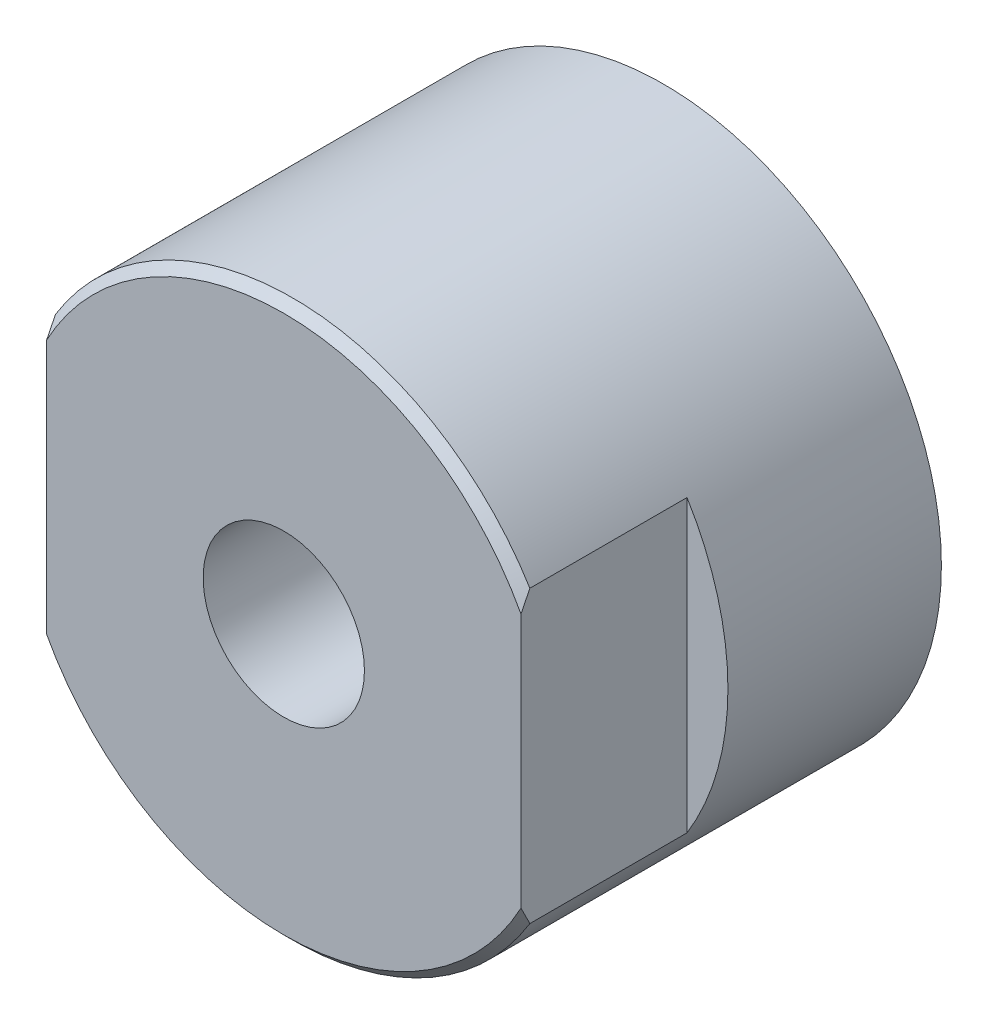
ISO-10303-21;
HEADER;
FILE_DESCRIPTION(('STEP AP214'),'2;1');
FILE_NAME('part.step','',(''),(''),'','','');
FILE_SCHEMA(('AUTOMOTIVE_DESIGN { 1 0 10303 214 1 1 1 1 }'));
ENDSEC;
DATA;
#1=APPLICATION_CONTEXT('core data for automotive mechanical design processes');
#2=APPLICATION_PROTOCOL_DEFINITION('international standard','automotive_design',2000,#1);
#3=PRODUCT_CONTEXT('',#1,'mechanical');
#4=PRODUCT('Part','Part','',(#3));
#5=PRODUCT_RELATED_PRODUCT_CATEGORY('part','',(#4));
#6=PRODUCT_DEFINITION_FORMATION('','',#4);
#7=PRODUCT_DEFINITION_CONTEXT('part definition',#1,'design');
#8=PRODUCT_DEFINITION('design','',#6,#7);
#9=PRODUCT_DEFINITION_SHAPE('','',#8);
#10=(LENGTH_UNIT() NAMED_UNIT(*) SI_UNIT(.MILLI.,.METRE.));
#11=(NAMED_UNIT(*) PLANE_ANGLE_UNIT() SI_UNIT($,.RADIAN.));
#12=(NAMED_UNIT(*) SI_UNIT($,.STERADIAN.) SOLID_ANGLE_UNIT());
#13=UNCERTAINTY_MEASURE_WITH_UNIT(LENGTH_MEASURE(1.E-05),#10,'distance_accuracy_value','');
#14=(GEOMETRIC_REPRESENTATION_CONTEXT(3) GLOBAL_UNCERTAINTY_ASSIGNED_CONTEXT((#13)) GLOBAL_UNIT_ASSIGNED_CONTEXT((#10,
#11,#12)) REPRESENTATION_CONTEXT('',''));
#15=CARTESIAN_POINT('',(0.,0.,0.));
#16=DIRECTION('',(0.,0.,1.));
#17=DIRECTION('',(1.,0.,0.));
#18=AXIS2_PLACEMENT_3D('',#15,#16,#17);
#19=CARTESIAN_POINT('',(0.,0.,0.));
#20=DIRECTION('',(0.,0.,1.));
#21=DIRECTION('',(1.,0.,0.));
#22=AXIS2_PLACEMENT_3D('',#19,#20,#21);
#23=PLANE('',#22);
#24=CARTESIAN_POINT('',(0.,0.,0.));
#25=DIRECTION('',(0.,0.,1.));
#26=DIRECTION('',(1.,0.,0.));
#27=AXIS2_PLACEMENT_3D('',#24,#25,#26);
#28=CIRCLE('',#27,6.1214);
#29=CARTESIAN_POINT('',(6.1214,0.,0.));
#30=VERTEX_POINT('',#29);
#31=EDGE_CURVE('E38',#30,#30,#28,.F.);
#32=ORIENTED_EDGE('',*,*,#31,.T.);
#33=EDGE_LOOP('',(#32));
#34=FACE_BOUND('',#33,.T.);
#35=CARTESIAN_POINT('',(0.,0.,0.));
#36=DIRECTION('',(0.,0.,-1.));
#37=DIRECTION('',(-1.,0.,0.));
#38=AXIS2_PLACEMENT_3D('',#35,#36,#37);
#39=CIRCLE('',#38,4.2164);
#40=CARTESIAN_POINT('',(-4.2164,0.,0.));
#41=VERTEX_POINT('',#40);
#42=EDGE_CURVE('E108',#41,#41,#39,.T.);
#43=ORIENTED_EDGE('',*,*,#42,.F.);
#44=EDGE_LOOP('',(#43));
#45=FACE_BOUND('',#44,.T.);
#46=ADVANCED_FACE('F30',(#34,#45),#23,.F.);
#47=CARTESIAN_POINT('',(0.,0.,0.));
#48=DIRECTION('',(0.,0.,1.));
#49=DIRECTION('',(1.,0.,0.));
#50=AXIS2_PLACEMENT_3D('',#47,#48,#49);
#51=CYLINDRICAL_SURFACE('',#50,3.4544);
#52=CARTESIAN_POINT('',(0.,0.,16.256));
#53=DIRECTION('',(0.,0.,1.));
#54=DIRECTION('',(1.,0.,0.));
#55=AXIS2_PLACEMENT_3D('',#52,#53,#54);
#56=CIRCLE('',#55,3.4544);
#57=CARTESIAN_POINT('',(3.4544,0.,16.256));
#58=VERTEX_POINT('',#57);
#59=EDGE_CURVE('E115',#58,#58,#56,.T.);
#60=ORIENTED_EDGE('',*,*,#59,.T.);
#61=EDGE_LOOP('',(#60));
#62=FACE_BOUND('',#61,.T.);
#63=CARTESIAN_POINT('',(0.,0.,9.906));
#64=DIRECTION('',(0.,0.,-1.));
#65=DIRECTION('',(-1.,0.,0.));
#66=AXIS2_PLACEMENT_3D('',#63,#64,#65);
#67=CIRCLE('',#66,3.4544);
#68=CARTESIAN_POINT('',(-3.4544,0.,9.906));
#69=VERTEX_POINT('',#68);
#70=EDGE_CURVE('E114',#69,#69,#67,.F.);
#71=ORIENTED_EDGE('',*,*,#70,.F.);
#72=EDGE_LOOP('',(#71));
#73=FACE_BOUND('',#72,.T.);
#74=ADVANCED_FACE('F181',(#62,#73),#51,.F.);
#75=CARTESIAN_POINT('',(0.,0.,16.256));
#76=DIRECTION('',(0.,0.,-1.));
#77=DIRECTION('',(-1.,0.,0.));
#78=AXIS2_PLACEMENT_3D('',#75,#76,#77);
#79=CYLINDRICAL_SURFACE('',#78,11.9126);
#80=DIRECTION('',(0.,0.,-1.));
#81=VECTOR('',#80,1.);
#82=CARTESIAN_POINT('',(10.16,-6.21968156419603,16.256));
#83=LINE('',#82,#81);
#84=CARTESIAN_POINT('',(10.16,-6.21968156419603,9.144));
#85=VERTEX_POINT('',#84);
#86=CARTESIAN_POINT('',(10.16,-6.21968156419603,15.875));
#87=VERTEX_POINT('',#86);
#88=EDGE_CURVE('E104',#85,#87,#83,.F.);
#89=ORIENTED_EDGE('',*,*,#88,.T.);
#90=CARTESIAN_POINT('',(0.,0.,15.875));
#91=DIRECTION('',(0.,0.,1.));
#92=DIRECTION('',(1.,0.,0.));
#93=AXIS2_PLACEMENT_3D('',#90,#91,#92);
#94=CIRCLE('',#93,11.9126);
#95=CARTESIAN_POINT('',(-10.16,-6.21968156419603,15.875));
#96=VERTEX_POINT('',#95);
#97=EDGE_CURVE('E53',#87,#96,#94,.F.);
#98=ORIENTED_EDGE('',*,*,#97,.T.);
#99=DIRECTION('',(0.,0.,-1.));
#100=VECTOR('',#99,1.);
#101=CARTESIAN_POINT('',(-10.16,-6.21968156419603,16.256));
#102=LINE('',#101,#100);
#103=CARTESIAN_POINT('',(-10.16,-6.21968156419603,9.144));
#104=VERTEX_POINT('',#103);
#105=EDGE_CURVE('E82',#96,#104,#102,.T.);
#106=ORIENTED_EDGE('',*,*,#105,.T.);
#107=CARTESIAN_POINT('',(0.,0.,9.144));
#108=DIRECTION('',(0.,0.,1.));
#109=DIRECTION('',(1.,0.,0.));
#110=AXIS2_PLACEMENT_3D('',#107,#108,#109);
#111=CIRCLE('',#110,11.9126);
#112=CARTESIAN_POINT('',(-10.16,6.21968156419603,9.144));
#113=VERTEX_POINT('',#112);
#114=EDGE_CURVE('E85',#113,#104,#111,.T.);
#115=ORIENTED_EDGE('',*,*,#114,.F.);
#116=DIRECTION('',(0.,0.,-1.));
#117=VECTOR('',#116,1.);
#118=CARTESIAN_POINT('',(-10.16,6.21968156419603,16.256));
#119=LINE('',#118,#117);
#120=CARTESIAN_POINT('',(-10.16,6.21968156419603,15.875));
#121=VERTEX_POINT('',#120);
#122=EDGE_CURVE('E89',#113,#121,#119,.F.);
#123=ORIENTED_EDGE('',*,*,#122,.T.);
#124=CARTESIAN_POINT('',(0.,0.,15.875));
#125=DIRECTION('',(0.,0.,1.));
#126=DIRECTION('',(1.,0.,0.));
#127=AXIS2_PLACEMENT_3D('',#124,#125,#126);
#128=CIRCLE('',#127,11.9126);
#129=CARTESIAN_POINT('',(10.16,6.21968156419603,15.875));
#130=VERTEX_POINT('',#129);
#131=EDGE_CURVE('E381',#121,#130,#128,.F.);
#132=ORIENTED_EDGE('',*,*,#131,.T.);
#133=DIRECTION('',(0.,0.,-1.));
#134=VECTOR('',#133,1.);
#135=CARTESIAN_POINT('',(10.16,6.21968156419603,16.256));
#136=LINE('',#135,#134);
#137=CARTESIAN_POINT('',(10.16,6.21968156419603,9.144));
#138=VERTEX_POINT('',#137);
#139=EDGE_CURVE('E106',#130,#138,#136,.T.);
#140=ORIENTED_EDGE('',*,*,#139,.T.);
#141=CARTESIAN_POINT('',(0.,0.,9.144));
#142=DIRECTION('',(0.,0.,-1.));
#143=DIRECTION('',(-1.,0.,0.));
#144=AXIS2_PLACEMENT_3D('',#141,#142,#143);
#145=CIRCLE('',#144,11.9126);
#146=EDGE_CURVE('E126',#138,#85,#145,.T.);
#147=ORIENTED_EDGE('',*,*,#146,.T.);
#148=EDGE_LOOP('',(#89,#98,#106,#115,#123,#132,#140,#147));
#149=FACE_BOUND('',#148,.T.);
#150=CARTESIAN_POINT('',(0.,0.,0.));
#151=DIRECTION('',(0.,0.,1.));
#152=DIRECTION('',(1.,0.,0.));
#153=AXIS2_PLACEMENT_3D('',#150,#151,#152);
#154=CIRCLE('',#153,11.9126);
#155=CARTESIAN_POINT('',(11.9126,0.,0.));
#156=VERTEX_POINT('',#155);
#157=EDGE_CURVE('E118',#156,#156,#154,.T.);
#158=ORIENTED_EDGE('',*,*,#157,.T.);
#159=EDGE_LOOP('',(#158));
#160=FACE_BOUND('',#159,.T.);
#161=ADVANCED_FACE('F32',(#149,#160),#79,.T.);
#162=CARTESIAN_POINT('',(0.,0.,16.256));
#163=DIRECTION('',(0.,0.,1.));
#164=DIRECTION('',(1.,0.,0.));
#165=AXIS2_PLACEMENT_3D('',#162,#163,#164);
#166=PLANE('',#165);
#167=DIRECTION('',(0.,1.,0.));
#168=VECTOR('',#167,1.);
#169=CARTESIAN_POINT('',(-10.16,0.,16.256));
#170=LINE('',#169,#168);
#171=CARTESIAN_POINT('',(-10.16,-5.4545575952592,16.256));
#172=VERTEX_POINT('',#171);
#173=CARTESIAN_POINT('',(-10.16,5.4545575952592,16.256));
#174=VERTEX_POINT('',#173);
#175=EDGE_CURVE('E96',#172,#174,#170,.T.);
#176=ORIENTED_EDGE('',*,*,#175,.F.);
#177=CARTESIAN_POINT('',(0.,0.,16.256));
#178=DIRECTION('',(0.,0.,1.));
#179=DIRECTION('',(1.,0.,0.));
#180=AXIS2_PLACEMENT_3D('',#177,#178,#179);
#181=CIRCLE('',#180,11.5316);
#182=CARTESIAN_POINT('',(10.16,-5.4545575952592,16.256));
#183=VERTEX_POINT('',#182);
#184=EDGE_CURVE('E132',#172,#183,#181,.T.);
#185=ORIENTED_EDGE('',*,*,#184,.T.);
#186=DIRECTION('',(0.,-1.,0.));
#187=VECTOR('',#186,1.);
#188=CARTESIAN_POINT('',(10.16,0.,16.256));
#189=LINE('',#188,#187);
#190=CARTESIAN_POINT('',(10.16,5.4545575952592,16.256));
#191=VERTEX_POINT('',#190);
#192=EDGE_CURVE('E121',#191,#183,#189,.T.);
#193=ORIENTED_EDGE('',*,*,#192,.F.);
#194=CARTESIAN_POINT('',(0.,0.,16.256));
#195=DIRECTION('',(0.,0.,1.));
#196=DIRECTION('',(1.,0.,0.));
#197=AXIS2_PLACEMENT_3D('',#194,#195,#196);
#198=CIRCLE('',#197,11.5316);
#199=EDGE_CURVE('E95',#191,#174,#198,.T.);
#200=ORIENTED_EDGE('',*,*,#199,.T.);
#201=EDGE_LOOP('',(#176,#185,#193,#200));
#202=FACE_BOUND('',#201,.T.);
#203=ORIENTED_EDGE('',*,*,#59,.F.);
#204=EDGE_LOOP('',(#203));
#205=FACE_BOUND('',#204,.T.);
#206=ADVANCED_FACE('F186',(#202,#205),#166,.T.);
#207=CARTESIAN_POINT('',(0.,0.,0.));
#208=DIRECTION('',(0.,0.,1.));
#209=DIRECTION('',(1.,0.,0.));
#210=AXIS2_PLACEMENT_3D('',#207,#208,#209);
#211=CIRCLE('',#210,8.4582);
#212=CARTESIAN_POINT('',(8.4582,0.,0.));
#213=VERTEX_POINT('',#212);
#214=EDGE_CURVE('E205',#213,#213,#211,.T.);
#215=ORIENTED_EDGE('',*,*,#214,.T.);
#216=EDGE_LOOP('',(#215));
#217=FACE_BOUND('',#216,.T.);
#218=ORIENTED_EDGE('',*,*,#157,.F.);
#219=EDGE_LOOP('',(#218));
#220=FACE_BOUND('',#219,.T.);
#221=ADVANCED_FACE('F176',(#217,#220),#23,.F.);
#222=CARTESIAN_POINT('',(0.,0.,9.906));
#223=DIRECTION('',(0.,0.,-1.));
#224=DIRECTION('',(-1.,0.,0.));
#225=AXIS2_PLACEMENT_3D('',#222,#223,#224);
#226=PLANE('',#225);
#227=CARTESIAN_POINT('',(0.,0.,9.906));
#228=DIRECTION('',(0.,0.,-1.));
#229=DIRECTION('',(-1.,0.,0.));
#230=AXIS2_PLACEMENT_3D('',#227,#228,#229);
#231=CIRCLE('',#230,4.2164);
#232=CARTESIAN_POINT('',(-4.2164,0.,9.906));
#233=VERTEX_POINT('',#232);
#234=EDGE_CURVE('E111',#233,#233,#231,.T.);
#235=ORIENTED_EDGE('',*,*,#234,.T.);
#236=EDGE_LOOP('',(#235));
#237=FACE_BOUND('',#236,.T.);
#238=ORIENTED_EDGE('',*,*,#70,.T.);
#239=EDGE_LOOP('',(#238));
#240=FACE_BOUND('',#239,.T.);
#241=ADVANCED_FACE('F173',(#237,#240),#226,.T.);
#242=CARTESIAN_POINT('',(0.,0.,9.906));
#243=DIRECTION('',(0.,0.,-1.));
#244=DIRECTION('',(-1.,0.,0.));
#245=AXIS2_PLACEMENT_3D('',#242,#243,#244);
#246=CYLINDRICAL_SURFACE('',#245,4.2164);
#247=ORIENTED_EDGE('',*,*,#234,.F.);
#248=EDGE_LOOP('',(#247));
#249=FACE_BOUND('',#248,.T.);
#250=ORIENTED_EDGE('',*,*,#42,.T.);
#251=EDGE_LOOP('',(#250));
#252=FACE_BOUND('',#251,.T.);
#253=ADVANCED_FACE('F171',(#249,#252),#246,.F.);
#254=CARTESIAN_POINT('',(0.,0.,1.397));
#255=DIRECTION('',(0.,0.,-1.));
#256=DIRECTION('',(-1.,0.,0.));
#257=AXIS2_PLACEMENT_3D('',#254,#255,#256);
#258=CYLINDRICAL_SURFACE('',#257,8.3312);
#259=CARTESIAN_POINT('',(0.,0.,0.127));
#260=DIRECTION('',(0.,0.,1.));
#261=DIRECTION('',(1.,0.,0.));
#262=AXIS2_PLACEMENT_3D('',#259,#260,#261);
#263=CIRCLE('',#262,8.3312);
#264=CARTESIAN_POINT('',(8.3312,0.,0.127));
#265=VERTEX_POINT('',#264);
#266=EDGE_CURVE('E207',#265,#265,#263,.F.);
#267=ORIENTED_EDGE('',*,*,#266,.T.);
#268=EDGE_LOOP('',(#267));
#269=FACE_BOUND('',#268,.T.);
#270=CARTESIAN_POINT('',(0.,0.,1.016));
#271=DIRECTION('',(0.,0.,-1.));
#272=DIRECTION('',(-1.,0.,0.));
#273=AXIS2_PLACEMENT_3D('',#270,#271,#272);
#274=CIRCLE('',#273,8.3312);
#275=CARTESIAN_POINT('',(-8.3312,0.,1.016));
#276=VERTEX_POINT('',#275);
#277=EDGE_CURVE('E215',#276,#276,#274,.F.);
#278=ORIENTED_EDGE('',*,*,#277,.T.);
#279=EDGE_LOOP('',(#278));
#280=FACE_BOUND('',#279,.T.);
#281=ADVANCED_FACE('F167',(#269,#280),#258,.F.);
#282=CARTESIAN_POINT('',(0.,0.,1.397));
#283=DIRECTION('',(0.,0.,-1.));
#284=DIRECTION('',(-1.,0.,0.));
#285=AXIS2_PLACEMENT_3D('',#282,#283,#284);
#286=PLANE('',#285);
#287=CARTESIAN_POINT('',(0.,0.,1.397));
#288=DIRECTION('',(0.,0.,-1.));
#289=DIRECTION('',(-1.,0.,0.));
#290=AXIS2_PLACEMENT_3D('',#287,#288,#289);
#291=CIRCLE('',#290,7.9502);
#292=CARTESIAN_POINT('',(-7.9502,0.,1.397));
#293=VERTEX_POINT('',#292);
#294=EDGE_CURVE('E218',#293,#293,#291,.T.);
#295=ORIENTED_EDGE('',*,*,#294,.T.);
#296=EDGE_LOOP('',(#295));
#297=FACE_BOUND('',#296,.T.);
#298=CARTESIAN_POINT('',(0.,0.,1.397));
#299=DIRECTION('',(0.,0.,-1.));
#300=DIRECTION('',(-1.,0.,0.));
#301=AXIS2_PLACEMENT_3D('',#298,#299,#300);
#302=CIRCLE('',#301,6.6294);
#303=CARTESIAN_POINT('',(-6.6294,0.,1.397));
#304=VERTEX_POINT('',#303);
#305=EDGE_CURVE('E221',#304,#304,#302,.F.);
#306=ORIENTED_EDGE('',*,*,#305,.T.);
#307=EDGE_LOOP('',(#306));
#308=FACE_BOUND('',#307,.T.);
#309=ADVANCED_FACE('F163',(#297,#308),#286,.T.);
#310=CARTESIAN_POINT('',(0.,0.,1.397));
#311=DIRECTION('',(0.,0.,-1.));
#312=DIRECTION('',(-1.,0.,0.));
#313=AXIS2_PLACEMENT_3D('',#310,#311,#312);
#314=CYLINDRICAL_SURFACE('',#313,6.2484);
#315=CARTESIAN_POINT('',(0.,0.,0.127));
#316=DIRECTION('',(0.,0.,1.));
#317=DIRECTION('',(1.,0.,0.));
#318=AXIS2_PLACEMENT_3D('',#315,#316,#317);
#319=CIRCLE('',#318,6.2484);
#320=CARTESIAN_POINT('',(6.2484,0.,0.127));
#321=VERTEX_POINT('',#320);
#322=EDGE_CURVE('E11',#321,#321,#319,.T.);
#323=ORIENTED_EDGE('',*,*,#322,.T.);
#324=EDGE_LOOP('',(#323));
#325=FACE_BOUND('',#324,.T.);
#326=CARTESIAN_POINT('',(0.,0.,1.016));
#327=DIRECTION('',(0.,0.,-1.));
#328=DIRECTION('',(-1.,0.,0.));
#329=AXIS2_PLACEMENT_3D('',#326,#327,#328);
#330=CIRCLE('',#329,6.2484);
#331=CARTESIAN_POINT('',(-6.2484,0.,1.016));
#332=VERTEX_POINT('',#331);
#333=EDGE_CURVE('E212',#332,#332,#330,.T.);
#334=ORIENTED_EDGE('',*,*,#333,.T.);
#335=EDGE_LOOP('',(#334));
#336=FACE_BOUND('',#335,.T.);
#337=ADVANCED_FACE('F159',(#325,#336),#314,.T.);
#338=CARTESIAN_POINT('',(10.16,12.9139489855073,9.144));
#339=DIRECTION('',(0.,0.,-1.));
#340=DIRECTION('',(-1.,0.,0.));
#341=AXIS2_PLACEMENT_3D('',#338,#339,#340);
#342=PLANE('',#341);
#343=DIRECTION('',(0.,-1.,0.));
#344=VECTOR('',#343,1.);
#345=CARTESIAN_POINT('',(10.16,12.9139489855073,9.144));
#346=LINE('',#345,#344);
#347=EDGE_CURVE('E88',#138,#85,#346,.T.);
#348=ORIENTED_EDGE('',*,*,#347,.T.);
#349=ORIENTED_EDGE('',*,*,#146,.F.);
#350=EDGE_LOOP('',(#348,#349));
#351=FACE_BOUND('',#350,.T.);
#352=ADVANCED_FACE('F156',(#351),#342,.F.);
#353=CARTESIAN_POINT('',(10.16,12.9139489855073,9.144));
#354=DIRECTION('',(-1.,0.,0.));
#355=DIRECTION('',(0.,0.,1.));
#356=AXIS2_PLACEMENT_3D('',#353,#354,#355);
#357=PLANE('',#356);
#358=ORIENTED_EDGE('',*,*,#192,.T.);
#359=CARTESIAN_POINT('',(10.16,-5.4545575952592,16.256));
#360=CARTESIAN_POINT('',(10.16,-5.51895345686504,16.2255399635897));
#361=CARTESIAN_POINT('',(10.16,-5.58318732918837,16.1947381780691));
#362=CARTESIAN_POINT('',(10.16,-5.7113307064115,16.1324826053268));
#363=CARTESIAN_POINT('',(10.16,-5.77524024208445,16.1010288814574));
#364=CARTESIAN_POINT('',(10.16,-5.90274669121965,16.0374951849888));
#365=CARTESIAN_POINT('',(10.16,-5.96634360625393,16.0054152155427));
#366=CARTESIAN_POINT('',(10.16,-6.09323752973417,15.9406524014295));
#367=CARTESIAN_POINT('',(10.16,-6.15653450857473,15.9079694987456));
#368=CARTESIAN_POINT('',(10.16,-6.21968156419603,15.875));
#369=B_SPLINE_CURVE_WITH_KNOTS('',3,(#359,#360,#361,#362,#363,#364,#365,#366,#367,#368),
.UNSPECIFIED.,.F.,.F.,(4,2,2,2,4),(0.,0.213708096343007,0.427395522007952,0.641081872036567,
0.854788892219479),.UNSPECIFIED.);
#370=EDGE_CURVE('E142',#183,#87,#369,.T.);
#371=ORIENTED_EDGE('',*,*,#370,.T.);
#372=ORIENTED_EDGE('',*,*,#88,.F.);
#373=ORIENTED_EDGE('',*,*,#347,.F.);
#374=ORIENTED_EDGE('',*,*,#139,.F.);
#375=CARTESIAN_POINT('',(10.16,6.21968156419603,15.875));
#376=CARTESIAN_POINT('',(10.16,6.15653450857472,15.9079694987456));
#377=CARTESIAN_POINT('',(10.16,6.09323752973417,15.9406524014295));
#378=CARTESIAN_POINT('',(10.16,5.96634360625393,16.0054152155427));
#379=CARTESIAN_POINT('',(10.16,5.90274669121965,16.0374951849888));
#380=CARTESIAN_POINT('',(10.16,5.77524024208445,16.1010288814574));
#381=CARTESIAN_POINT('',(10.16,5.7113307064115,16.1324826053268));
#382=CARTESIAN_POINT('',(10.16,5.58318732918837,16.1947381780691));
#383=CARTESIAN_POINT('',(10.16,5.51895345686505,16.2255399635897));
#384=CARTESIAN_POINT('',(10.16,5.45455759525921,16.256));
#385=B_SPLINE_CURVE_WITH_KNOTS('',3,(#375,#376,#377,#378,#379,#380,#381,#382,#383,#384),
.UNSPECIFIED.,.F.,.F.,(4,2,2,2,4),(0.,0.213707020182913,0.427393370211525,0.641080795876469,
0.854788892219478),.UNSPECIFIED.);
#386=EDGE_CURVE('E135',#130,#191,#385,.T.);
#387=ORIENTED_EDGE('',*,*,#386,.T.);
#388=EDGE_LOOP('',(#358,#371,#372,#373,#374,#387));
#389=FACE_BOUND('',#388,.T.);
#390=ADVANCED_FACE('F151',(#389),#357,.F.);
#391=CARTESIAN_POINT('',(-10.16,12.9139489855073,9.144));
#392=DIRECTION('',(0.,0.,1.));
#393=DIRECTION('',(1.,0.,0.));
#394=AXIS2_PLACEMENT_3D('',#391,#392,#393);
#395=PLANE('',#394);
#396=ORIENTED_EDGE('',*,*,#114,.T.);
#397=DIRECTION('',(0.,1.,0.));
#398=VECTOR('',#397,1.);
#399=CARTESIAN_POINT('',(-10.16,12.9139489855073,9.144));
#400=LINE('',#399,#398);
#401=EDGE_CURVE('E94',#104,#113,#400,.T.);
#402=ORIENTED_EDGE('',*,*,#401,.T.);
#403=EDGE_LOOP('',(#396,#402));
#404=FACE_BOUND('',#403,.T.);
#405=ADVANCED_FACE('F93',(#404),#395,.T.);
#406=CARTESIAN_POINT('',(-10.16,12.9139489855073,9.144));
#407=DIRECTION('',(1.,0.,0.));
#408=DIRECTION('',(0.,0.,-1.));
#409=AXIS2_PLACEMENT_3D('',#406,#407,#408);
#410=PLANE('',#409);
#411=ORIENTED_EDGE('',*,*,#105,.F.);
#412=CARTESIAN_POINT('',(-10.16,-6.21968156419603,15.875));
#413=CARTESIAN_POINT('',(-10.16,-6.15653450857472,15.9079694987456));
#414=CARTESIAN_POINT('',(-10.16,-6.09323752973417,15.9406524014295));
#415=CARTESIAN_POINT('',(-10.16,-5.96634360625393,16.0054152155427));
#416=CARTESIAN_POINT('',(-10.16,-5.90274669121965,16.0374951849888));
#417=CARTESIAN_POINT('',(-10.16,-5.77524024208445,16.1010288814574));
#418=CARTESIAN_POINT('',(-10.16,-5.7113307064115,16.1324826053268));
#419=CARTESIAN_POINT('',(-10.16,-5.58318732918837,16.1947381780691));
#420=CARTESIAN_POINT('',(-10.16,-5.51895345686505,16.2255399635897));
#421=CARTESIAN_POINT('',(-10.16,-5.45455759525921,16.256));
#422=B_SPLINE_CURVE_WITH_KNOTS('',3,(#412,#413,#414,#415,#416,#417,#418,#419,#420,#421),
.UNSPECIFIED.,.F.,.F.,(4,2,2,2,4),(0.,0.213707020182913,0.427393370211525,0.641080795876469,
0.854788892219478),.UNSPECIFIED.);
#423=EDGE_CURVE('E224',#96,#172,#422,.T.);
#424=ORIENTED_EDGE('',*,*,#423,.T.);
#425=ORIENTED_EDGE('',*,*,#175,.T.);
#426=CARTESIAN_POINT('',(-10.16,5.4545575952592,16.256));
#427=CARTESIAN_POINT('',(-10.16,5.51895345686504,16.2255399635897));
#428=CARTESIAN_POINT('',(-10.16,5.58318732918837,16.1947381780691));
#429=CARTESIAN_POINT('',(-10.16,5.7113307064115,16.1324826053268));
#430=CARTESIAN_POINT('',(-10.16,5.77524024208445,16.1010288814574));
#431=CARTESIAN_POINT('',(-10.16,5.90274669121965,16.0374951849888));
#432=CARTESIAN_POINT('',(-10.16,5.96634360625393,16.0054152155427));
#433=CARTESIAN_POINT('',(-10.16,6.09323752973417,15.9406524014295));
#434=CARTESIAN_POINT('',(-10.16,6.15653450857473,15.9079694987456));
#435=CARTESIAN_POINT('',(-10.16,6.21968156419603,15.875));
#436=B_SPLINE_CURVE_WITH_KNOTS('',3,(#426,#427,#428,#429,#430,#431,#432,#433,#434,#435),
.UNSPECIFIED.,.F.,.F.,(4,2,2,2,4),(0.,0.213708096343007,0.427395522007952,0.641081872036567,
0.854788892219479),.UNSPECIFIED.);
#437=EDGE_CURVE('E45',#174,#121,#436,.T.);
#438=ORIENTED_EDGE('',*,*,#437,.T.);
#439=ORIENTED_EDGE('',*,*,#122,.F.);
#440=ORIENTED_EDGE('',*,*,#401,.F.);
#441=EDGE_LOOP('',(#411,#424,#425,#438,#439,#440));
#442=FACE_BOUND('',#441,.T.);
#443=ADVANCED_FACE('F98',(#442),#410,.F.);
#444=CARTESIAN_POINT('',(0.,0.,16.256));
#445=DIRECTION('',(0.,0.,-1.));
#446=DIRECTION('',(-1.,0.,0.));
#447=AXIS2_PLACEMENT_3D('',#444,#445,#446);
#448=CONICAL_SURFACE('',#447,11.5316,0.785398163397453);
#449=ORIENTED_EDGE('',*,*,#423,.F.);
#450=ORIENTED_EDGE('',*,*,#97,.F.);
#451=ORIENTED_EDGE('',*,*,#370,.F.);
#452=ORIENTED_EDGE('',*,*,#184,.F.);
#453=EDGE_LOOP('',(#449,#450,#451,#452));
#454=FACE_BOUND('',#453,.T.);
#455=ADVANCED_FACE('F233',(#454),#448,.T.);
#456=CARTESIAN_POINT('',(0.,0.,16.256));
#457=DIRECTION('',(0.,0.,-1.));
#458=DIRECTION('',(-1.,0.,0.));
#459=AXIS2_PLACEMENT_3D('',#456,#457,#458);
#460=CONICAL_SURFACE('',#459,11.5316,0.785398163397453);
#461=ORIENTED_EDGE('',*,*,#386,.F.);
#462=ORIENTED_EDGE('',*,*,#131,.F.);
#463=ORIENTED_EDGE('',*,*,#437,.F.);
#464=ORIENTED_EDGE('',*,*,#199,.F.);
#465=EDGE_LOOP('',(#461,#462,#463,#464));
#466=FACE_BOUND('',#465,.T.);
#467=ADVANCED_FACE('F148',(#466),#460,.T.);
#468=CARTESIAN_POINT('',(0.,0.,1.016));
#469=DIRECTION('',(0.,0.,-1.));
#470=DIRECTION('',(-1.,0.,0.));
#471=AXIS2_PLACEMENT_3D('',#468,#469,#470);
#472=TOROIDAL_SURFACE('',#471,7.9502,0.381);
#473=ORIENTED_EDGE('',*,*,#277,.F.);
#474=EDGE_LOOP('',(#473));
#475=FACE_BOUND('',#474,.T.);
#476=ORIENTED_EDGE('',*,*,#294,.F.);
#477=EDGE_LOOP('',(#476));
#478=FACE_BOUND('',#477,.T.);
#479=ADVANCED_FACE('F261',(#475,#478),#472,.F.);
#480=CARTESIAN_POINT('',(0.,0.,1.016));
#481=DIRECTION('',(0.,0.,-1.));
#482=DIRECTION('',(-1.,0.,0.));
#483=AXIS2_PLACEMENT_3D('',#480,#481,#482);
#484=TOROIDAL_SURFACE('',#483,6.6294,0.381);
#485=ORIENTED_EDGE('',*,*,#305,.F.);
#486=EDGE_LOOP('',(#485));
#487=FACE_BOUND('',#486,.T.);
#488=ORIENTED_EDGE('',*,*,#333,.F.);
#489=EDGE_LOOP('',(#488));
#490=FACE_BOUND('',#489,.T.);
#491=ADVANCED_FACE('F268',(#487,#490),#484,.F.);
#492=CARTESIAN_POINT('',(0.,0.,0.127));
#493=DIRECTION('',(0.,0.,1.));
#494=DIRECTION('',(1.,0.,0.));
#495=AXIS2_PLACEMENT_3D('',#492,#493,#494);
#496=TOROIDAL_SURFACE('',#495,8.4582,0.127);
#497=ORIENTED_EDGE('',*,*,#214,.F.);
#498=EDGE_LOOP('',(#497));
#499=FACE_BOUND('',#498,.T.);
#500=ORIENTED_EDGE('',*,*,#266,.F.);
#501=EDGE_LOOP('',(#500));
#502=FACE_BOUND('',#501,.T.);
#503=ADVANCED_FACE('F275',(#499,#502),#496,.T.);
#504=CARTESIAN_POINT('',(0.,0.,0.127));
#505=DIRECTION('',(0.,0.,1.));
#506=DIRECTION('',(1.,0.,0.));
#507=AXIS2_PLACEMENT_3D('',#504,#505,#506);
#508=TOROIDAL_SURFACE('',#507,6.1214,0.127);
#509=ORIENTED_EDGE('',*,*,#322,.F.);
#510=EDGE_LOOP('',(#509));
#511=FACE_BOUND('',#510,.T.);
#512=ORIENTED_EDGE('',*,*,#31,.F.);
#513=EDGE_LOOP('',(#512));
#514=FACE_BOUND('',#513,.T.);
#515=ADVANCED_FACE('F283',(#511,#514),#508,.T.);
#516=CLOSED_SHELL('',(#46,#74,#161,#206,#221,#241,#253,#281,#309,#337,#352,#390,#405,#443,#455,
#467,#479,#491,#503,#515));
#517=MANIFOLD_SOLID_BREP('B2',#516);
#518=ADVANCED_BREP_SHAPE_REPRESENTATION('',(#18,#517),#14);
#519=SHAPE_DEFINITION_REPRESENTATION(#9,#518);
ENDSEC;
END-ISO-10303-21;
